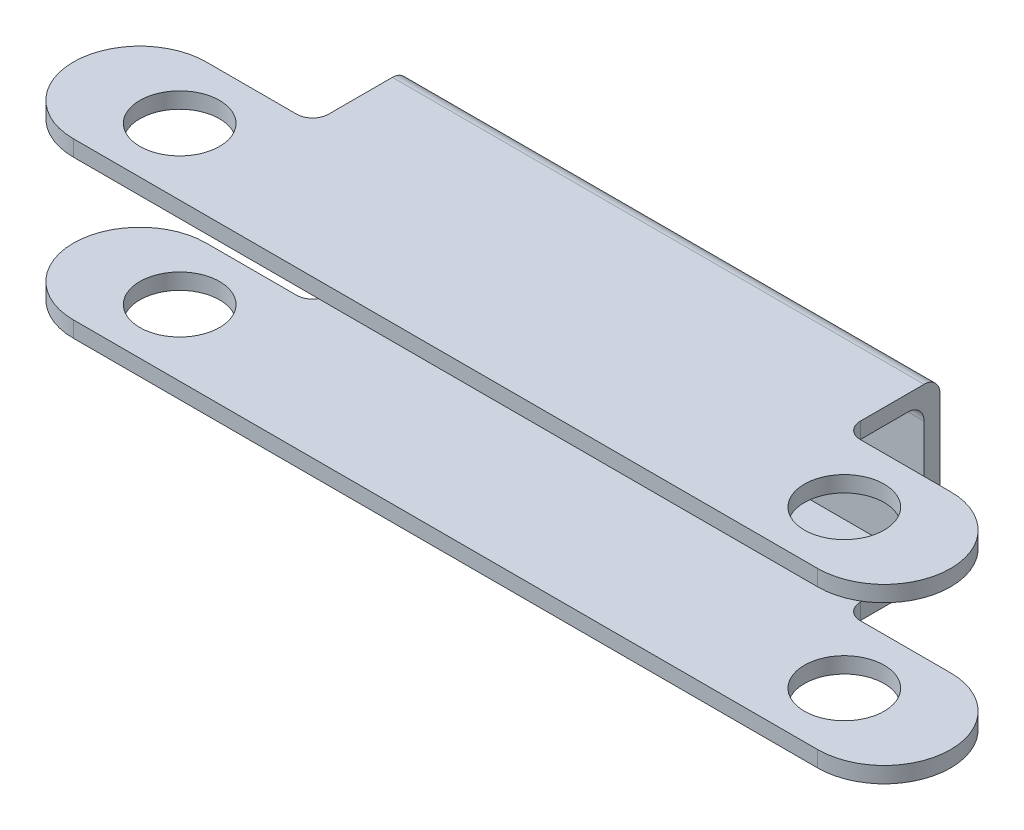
from build123d import *

# Parameters (mm, degrees)
SKIZZE1_R               = 15
LINEAR_AUSTRAGEN1_DEPTH = 6
SKIZZE4_W               = 200
SKIZZE4_H               = 6
LINEAR_AUSTRAGEN2_DEPTH = 68
VERRUNDUNG1_R           = 6
VERRUNDUNG2_R           = 6


with BuildPart() as part:
    # Skizze1 → Linear austragen1 (new body)
    with BuildSketch(Plane(origin=(0, 0, 0), x_dir=(1, 0, 0), z_dir=(0, 1, 0))):
        with BuildLine():
            Line((-140, 25), (-106, 25))
            ThreePointArc((-106, 25), (-101.757359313, 26.757359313), (-100, 31))
            Line((-100, 31), (-100, 55))
            Line((-100, 55), (100, 55))
            Line((100, 55), (100, 31))
            ThreePointArc((100, 31), (101.757359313, 26.757359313), (106, 25))
            Line((106, 25), (140, 25))
            ThreePointArc((140, 25), (165, 0), (140, -25))
            Line((140, -25), (-140, -25))
            ThreePointArc((-140, -25), (-165, 0), (-140, 25))
        make_face()
        with Locations(Location((-125, 0, 0), (0, 0, 270))):
            Circle(SKIZZE1_R, mode=Mode.SUBTRACT)
        with Locations(Location((125, 0, 0), (0, 0, 270))):
            Circle(SKIZZE1_R, mode=Mode.SUBTRACT)
    linear_austragen1 = extrude(amount=LINEAR_AUSTRAGEN1_DEPTH)

    # Skizze4 → Linear austragen2 (add)
    with BuildSketch(Plane(origin=(0, 6, 0), x_dir=(-1, 0, 0), z_dir=(0, 1, 0))):
        with Locations((0, -58)):
            Rectangle(SKIZZE4_W, SKIZZE4_H)
    extrude(amount=-LINEAR_AUSTRAGEN2_DEPTH)

    # Verrundung1
    verrundung1_edges = [part.edges().sort_by_distance(p)[0] for p in [
        (0, 6, -61),
    ]]
    fillet(verrundung1_edges, radius=VERRUNDUNG1_R)

    # Verrundung2
    verrundung2_edges = [part.edges().sort_by_distance(p)[0] for p in [
        (0, 0, -55),
    ]]
    fillet(verrundung2_edges, radius=VERRUNDUNG2_R)

    # Spiegeln4: Linear austragen1 across plane
    add(linear_austragen1.mirror(Plane(origin=(0, -26.5, 0), x_dir=(0, 0, 1), z_dir=(0, -1, 0))))


solid = part.part
